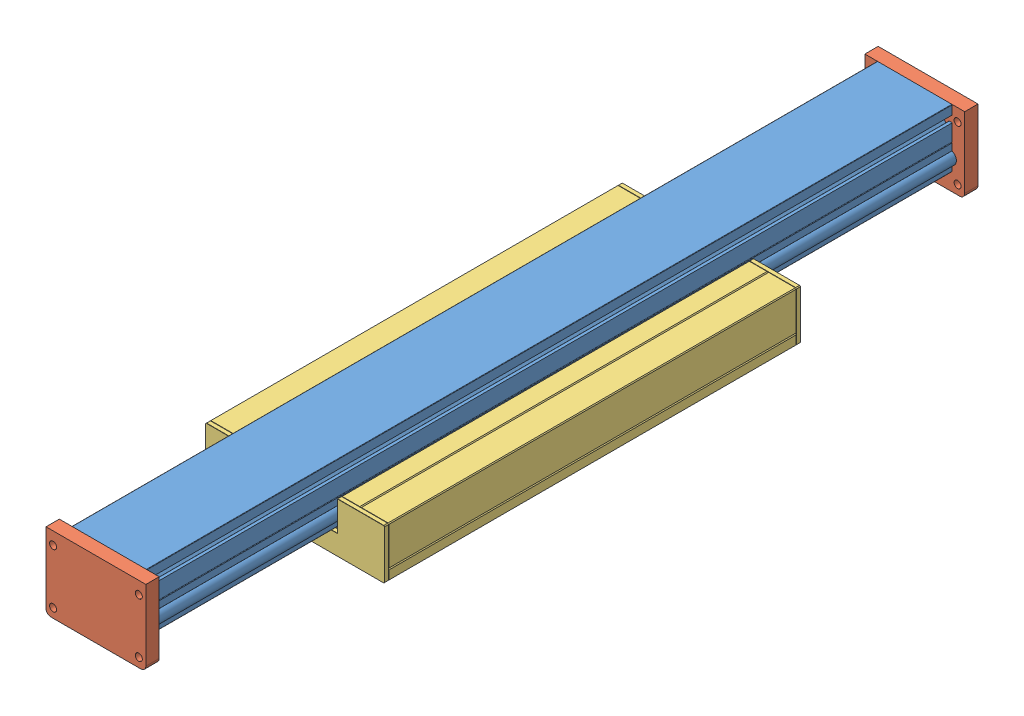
SolidWorks assembly MO090_500_1000.SLDASM, configuration Standard (file format 3800). Lengths in mm.
Overall size (215 95 1000).
4 component instances, 3 part files, 8 mates.
Components (placement in the parent):
- Profil_MZ090-1: Profil_MZ090.SLDPRT [l=968] at origin size (100.1 70 968)
- Endplatte_MO090-1: Endplatte_MO090.SLDPRT [vereinfacht] at (0 -13 0) x (0 0 1) z (1 0 0) size (16 91 120)
- Endplatte_MO090-2: Endplatte_MO090.SLDPRT [vereinfacht] at (0 -13 968) x (0 0 -1) z (-1 0 0) size (16 91 120)
- Schlitten_MZK090_500-1: Schlitten_MZK090_500.SLDPRT [Standard] at (0 35 494.7598) x (-1 0 0) z (0 0 1) size (215 60 500)
Mates (geometry in assembly coordinates):
- Deckungsgleich1: coincident anti-aligned: plane of Profil_MZ090-1 through (-45 35 0) normal (0 0 -1); plane of Endplatte_MO090-1 through (-54 -50 0) normal (0 0 1)
- Deckungsgleich2: coincident aligned: plane of Endplatte_MO090-1 through (60 35 -16) normal (0 1 0); plane of Profil_MZ090-1 through (-45 35 968) normal (0 1 0)
- Breite1: width: plane of Endplatte_MO090-1 through (60 -50 -16) normal (1 0 0); plane of Endplatte_MO090-1 through (-60 -50 -16) normal (-1 0 0); plane of Profil_MZ090-1 through (-45 35 968) normal (-1 0 0); plane of Profil_MZ090-1 through (45 35 968) normal (1 0 0)
- Deckungsgleich3: coincident anti-aligned: plane of Profil_MZ090-1 through (-45 35 968) normal (0 0 1); plane of Endplatte_MO090-2 through (54 -50 968) normal (0 0 -1)
- Deckungsgleich4: coincident aligned: plane of Endplatte_MO090-2 through (-60 35 984) normal (0 1 0); plane of Profil_MZ090-1 through (-45 35 968) normal (0 1 0)
- Breite2: width: plane of Endplatte_MO090-2 through (60 -50 984) normal (1 0 0); plane of Endplatte_MO090-2 through (-60 -50 984) normal (-1 0 0); plane of Profil_MZ090-1 through (-45 35 968) normal (-1 0 0); plane of Profil_MZ090-1 through (45 35 968) normal (1 0 0)
- Abstand1: distance = 95 mm anti-aligned: plane of Profil_MZ090-1 through (-45 35 968) normal (0 1 0); plane of Schlitten_MZK090_500-1 through (-107.5 -60 739.7598) normal (0 -1 0)
- Breite3: width: plane of Schlitten_MZK090_500-1 through (107.5 -60 739.7598) normal (1 0 0); plane of Schlitten_MZK090_500-1 through (-107.5 -60 739.7598) normal (-1 0 0); plane of Profil_MZ090-1 through (45 35 968) normal (1 0 0); plane of Profil_MZ090-1 through (-45 35 968) normal (-1 0 0)
